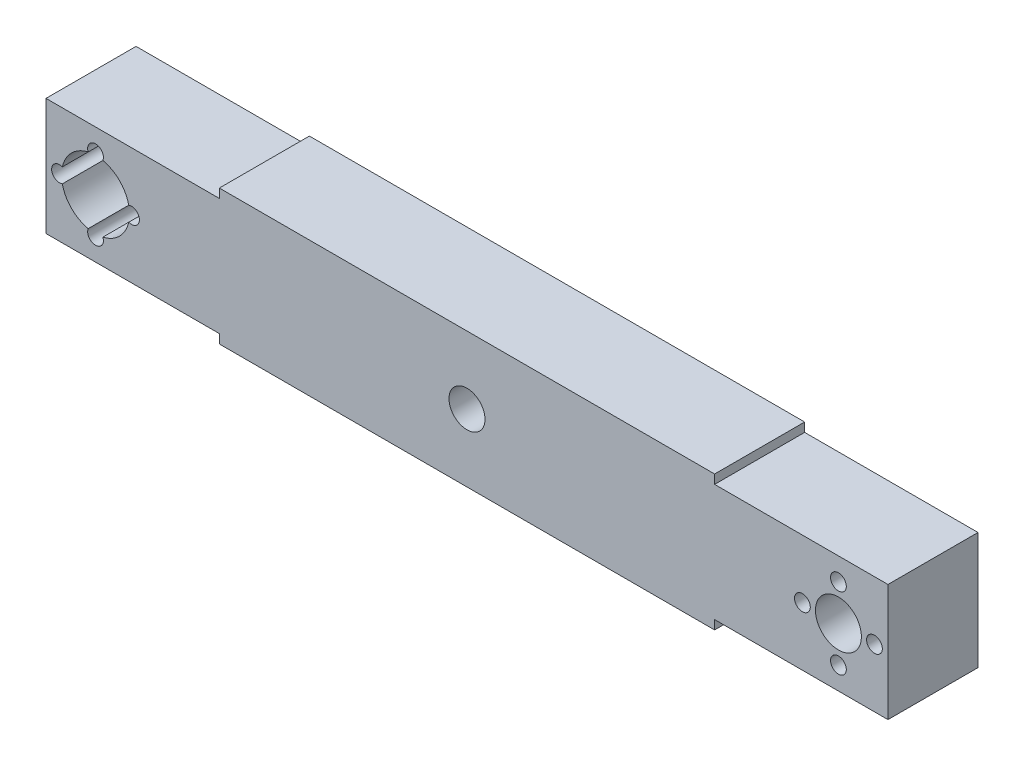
ISO-10303-21;
HEADER;
FILE_DESCRIPTION(('STEP AP214'),'2;1');
FILE_NAME('part.step','',(''),(''),'','','');
FILE_SCHEMA(('AUTOMOTIVE_DESIGN { 1 0 10303 214 1 1 1 1 }'));
ENDSEC;
DATA;
#1=APPLICATION_CONTEXT('core data for automotive mechanical design processes');
#2=APPLICATION_PROTOCOL_DEFINITION('international standard','automotive_design',2000,#1);
#3=PRODUCT_CONTEXT('',#1,'mechanical');
#4=PRODUCT('Part','Part','',(#3));
#5=PRODUCT_RELATED_PRODUCT_CATEGORY('part','',(#4));
#6=PRODUCT_DEFINITION_FORMATION('','',#4);
#7=PRODUCT_DEFINITION_CONTEXT('part definition',#1,'design');
#8=PRODUCT_DEFINITION('design','',#6,#7);
#9=PRODUCT_DEFINITION_SHAPE('','',#8);
#10=(LENGTH_UNIT() NAMED_UNIT(*) SI_UNIT(.MILLI.,.METRE.));
#11=(NAMED_UNIT(*) PLANE_ANGLE_UNIT() SI_UNIT($,.RADIAN.));
#12=(NAMED_UNIT(*) SI_UNIT($,.STERADIAN.) SOLID_ANGLE_UNIT());
#13=UNCERTAINTY_MEASURE_WITH_UNIT(LENGTH_MEASURE(1.E-05),#10,'distance_accuracy_value','');
#14=(GEOMETRIC_REPRESENTATION_CONTEXT(3) GLOBAL_UNCERTAINTY_ASSIGNED_CONTEXT((#13)) GLOBAL_UNIT_ASSIGNED_CONTEXT((#10,
#11,#12)) REPRESENTATION_CONTEXT('',''));
#15=CARTESIAN_POINT('',(0.,0.,0.));
#16=DIRECTION('',(0.,0.,1.));
#17=DIRECTION('',(1.,0.,0.));
#18=AXIS2_PLACEMENT_3D('',#15,#16,#17);
#19=CARTESIAN_POINT('',(55.,-15.,20.));
#20=DIRECTION('',(-1.,0.,0.));
#21=DIRECTION('',(0.,0.,1.));
#22=AXIS2_PLACEMENT_3D('',#19,#20,#21);
#23=PLANE('',#22);
#24=DIRECTION('',(0.,1.,0.));
#25=VECTOR('',#24,1.);
#26=CARTESIAN_POINT('',(55.,-15.,0.));
#27=LINE('',#26,#25);
#28=CARTESIAN_POINT('',(55.,-15.,0.));
#29=VERTEX_POINT('',#28);
#30=CARTESIAN_POINT('',(55.,-13.0000000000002,0.));
#31=VERTEX_POINT('',#30);
#32=EDGE_CURVE('E230',#29,#31,#27,.T.);
#33=ORIENTED_EDGE('',*,*,#32,.T.);
#34=DIRECTION('',(0.,0.,-1.));
#35=VECTOR('',#34,1.);
#36=CARTESIAN_POINT('',(55.,-13.0000000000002,20.001));
#37=LINE('',#36,#35);
#38=CARTESIAN_POINT('',(55.,-13.0000000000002,20.));
#39=VERTEX_POINT('',#38);
#40=EDGE_CURVE('E382',#39,#31,#37,.T.);
#41=ORIENTED_EDGE('',*,*,#40,.F.);
#42=DIRECTION('',(0.,1.,0.));
#43=VECTOR('',#42,1.);
#44=CARTESIAN_POINT('',(55.,-15.,20.));
#45=LINE('',#44,#43);
#46=CARTESIAN_POINT('',(55.,-15.,20.));
#47=VERTEX_POINT('',#46);
#48=EDGE_CURVE('E219',#47,#39,#45,.T.);
#49=ORIENTED_EDGE('',*,*,#48,.F.);
#50=DIRECTION('',(0.,0.,-1.));
#51=VECTOR('',#50,1.);
#52=CARTESIAN_POINT('',(55.,-15.,20.));
#53=LINE('',#52,#51);
#54=EDGE_CURVE('E229',#47,#29,#53,.T.);
#55=ORIENTED_EDGE('',*,*,#54,.T.);
#56=EDGE_LOOP('',(#33,#41,#49,#55));
#57=FACE_BOUND('',#56,.T.);
#58=ADVANCED_FACE('F39',(#57),#23,.F.);
#59=CARTESIAN_POINT('',(-55.,-15.,20.));
#60=DIRECTION('',(1.,0.,0.));
#61=DIRECTION('',(0.,0.,-1.));
#62=AXIS2_PLACEMENT_3D('',#59,#60,#61);
#63=PLANE('',#62);
#64=DIRECTION('',(0.,-1.,0.));
#65=VECTOR('',#64,1.);
#66=CARTESIAN_POINT('',(-55.,-15.,20.));
#67=LINE('',#66,#65);
#68=CARTESIAN_POINT('',(-55.,-13.0000000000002,20.));
#69=VERTEX_POINT('',#68);
#70=CARTESIAN_POINT('',(-55.,-15.,20.));
#71=VERTEX_POINT('',#70);
#72=EDGE_CURVE('E224',#69,#71,#67,.T.);
#73=ORIENTED_EDGE('',*,*,#72,.F.);
#74=DIRECTION('',(0.,0.,-1.));
#75=VECTOR('',#74,1.);
#76=CARTESIAN_POINT('',(-55.,-13.0000000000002,20.001));
#77=LINE('',#76,#75);
#78=CARTESIAN_POINT('',(-55.,-13.0000000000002,0.));
#79=VERTEX_POINT('',#78);
#80=EDGE_CURVE('E279',#69,#79,#77,.T.);
#81=ORIENTED_EDGE('',*,*,#80,.T.);
#82=DIRECTION('',(0.,-1.,0.));
#83=VECTOR('',#82,1.);
#84=CARTESIAN_POINT('',(-55.,-15.,0.));
#85=LINE('',#84,#83);
#86=CARTESIAN_POINT('',(-55.,-15.,0.));
#87=VERTEX_POINT('',#86);
#88=EDGE_CURVE('E234',#79,#87,#85,.T.);
#89=ORIENTED_EDGE('',*,*,#88,.T.);
#90=DIRECTION('',(0.,0.,-1.));
#91=VECTOR('',#90,1.);
#92=CARTESIAN_POINT('',(-55.,-15.,20.));
#93=LINE('',#92,#91);
#94=EDGE_CURVE('E241',#71,#87,#93,.T.);
#95=ORIENTED_EDGE('',*,*,#94,.F.);
#96=EDGE_LOOP('',(#73,#81,#89,#95));
#97=FACE_BOUND('',#96,.T.);
#98=ADVANCED_FACE('F412',(#97),#63,.F.);
#99=CARTESIAN_POINT('',(55.,13.,20.));
#100=VERTEX_POINT('',#99);
#101=CARTESIAN_POINT('',(55.,15.,20.));
#102=VERTEX_POINT('',#101);
#103=EDGE_CURVE('E222',#100,#102,#45,.T.);
#104=ORIENTED_EDGE('',*,*,#103,.F.);
#105=DIRECTION('',(0.,0.,-1.));
#106=VECTOR('',#105,1.);
#107=CARTESIAN_POINT('',(55.,13.,20.001));
#108=LINE('',#107,#106);
#109=CARTESIAN_POINT('',(55.,13.,0.));
#110=VERTEX_POINT('',#109);
#111=EDGE_CURVE('E256',#100,#110,#108,.T.);
#112=ORIENTED_EDGE('',*,*,#111,.T.);
#113=CARTESIAN_POINT('',(55.,15.,0.));
#114=VERTEX_POINT('',#113);
#115=EDGE_CURVE('E214',#110,#114,#27,.T.);
#116=ORIENTED_EDGE('',*,*,#115,.T.);
#117=DIRECTION('',(0.,0.,-1.));
#118=VECTOR('',#117,1.);
#119=CARTESIAN_POINT('',(55.,15.,20.));
#120=LINE('',#119,#118);
#121=EDGE_CURVE('E47',#102,#114,#120,.T.);
#122=ORIENTED_EDGE('',*,*,#121,.F.);
#123=EDGE_LOOP('',(#104,#112,#116,#122));
#124=FACE_BOUND('',#123,.T.);
#125=ADVANCED_FACE('F41',(#124),#23,.F.);
#126=CARTESIAN_POINT('',(-55.,15.,20.));
#127=DIRECTION('',(0.,-1.,0.));
#128=DIRECTION('',(0.,0.,-1.));
#129=AXIS2_PLACEMENT_3D('',#126,#127,#128);
#130=PLANE('',#129);
#131=DIRECTION('',(-1.,0.,0.));
#132=VECTOR('',#131,1.);
#133=CARTESIAN_POINT('',(-55.,15.,0.));
#134=LINE('',#133,#132);
#135=CARTESIAN_POINT('',(-55.,15.,0.));
#136=VERTEX_POINT('',#135);
#137=EDGE_CURVE('E232',#114,#136,#134,.T.);
#138=ORIENTED_EDGE('',*,*,#137,.T.);
#139=DIRECTION('',(0.,0.,-1.));
#140=VECTOR('',#139,1.);
#141=CARTESIAN_POINT('',(-55.,15.,20.));
#142=LINE('',#141,#140);
#143=CARTESIAN_POINT('',(-55.,15.,20.));
#144=VERTEX_POINT('',#143);
#145=EDGE_CURVE('E244',#144,#136,#142,.T.);
#146=ORIENTED_EDGE('',*,*,#145,.F.);
#147=DIRECTION('',(-1.,0.,0.));
#148=VECTOR('',#147,1.);
#149=CARTESIAN_POINT('',(-55.,15.,20.));
#150=LINE('',#149,#148);
#151=EDGE_CURVE('E221',#102,#144,#150,.T.);
#152=ORIENTED_EDGE('',*,*,#151,.F.);
#153=ORIENTED_EDGE('',*,*,#121,.T.);
#154=EDGE_LOOP('',(#138,#146,#152,#153));
#155=FACE_BOUND('',#154,.T.);
#156=ADVANCED_FACE('F250',(#155),#130,.F.);
#157=CARTESIAN_POINT('',(-55.,13.,0.));
#158=VERTEX_POINT('',#157);
#159=EDGE_CURVE('E235',#136,#158,#85,.T.);
#160=ORIENTED_EDGE('',*,*,#159,.T.);
#161=DIRECTION('',(0.,0.,-1.));
#162=VECTOR('',#161,1.);
#163=CARTESIAN_POINT('',(-55.,13.,20.001));
#164=LINE('',#163,#162);
#165=CARTESIAN_POINT('',(-55.,13.,20.));
#166=VERTEX_POINT('',#165);
#167=EDGE_CURVE('E273',#166,#158,#164,.T.);
#168=ORIENTED_EDGE('',*,*,#167,.F.);
#169=EDGE_CURVE('E225',#144,#166,#67,.T.);
#170=ORIENTED_EDGE('',*,*,#169,.F.);
#171=ORIENTED_EDGE('',*,*,#145,.T.);
#172=EDGE_LOOP('',(#160,#168,#170,#171));
#173=FACE_BOUND('',#172,.T.);
#174=ADVANCED_FACE('F271',(#173),#63,.F.);
#175=CARTESIAN_POINT('',(-55.,-15.,20.));
#176=DIRECTION('',(0.,1.,0.));
#177=DIRECTION('',(0.,0.,1.));
#178=AXIS2_PLACEMENT_3D('',#175,#176,#177);
#179=PLANE('',#178);
#180=DIRECTION('',(1.,0.,0.));
#181=VECTOR('',#180,1.);
#182=CARTESIAN_POINT('',(-55.,-15.,0.));
#183=LINE('',#182,#181);
#184=EDGE_CURVE('E237',#87,#29,#183,.T.);
#185=ORIENTED_EDGE('',*,*,#184,.T.);
#186=ORIENTED_EDGE('',*,*,#54,.F.);
#187=DIRECTION('',(1.,0.,0.));
#188=VECTOR('',#187,1.);
#189=CARTESIAN_POINT('',(-55.,-15.,20.));
#190=LINE('',#189,#188);
#191=EDGE_CURVE('E227',#71,#47,#190,.T.);
#192=ORIENTED_EDGE('',*,*,#191,.F.);
#193=ORIENTED_EDGE('',*,*,#94,.T.);
#194=EDGE_LOOP('',(#185,#186,#192,#193));
#195=FACE_BOUND('',#194,.T.);
#196=ADVANCED_FACE('F407',(#195),#179,.F.);
#197=CARTESIAN_POINT('',(0.,0.,20.));
#198=DIRECTION('',(0.,0.,-1.));
#199=DIRECTION('',(-1.,0.,0.));
#200=AXIS2_PLACEMENT_3D('',#197,#198,#199);
#201=PLANE('',#200);
#202=CARTESIAN_POINT('',(0.,0.,20.));
#203=DIRECTION('',(0.,0.,-1.));
#204=DIRECTION('',(-1.,0.,0.));
#205=AXIS2_PLACEMENT_3D('',#202,#203,#204);
#206=CIRCLE('',#205,4.);
#207=CARTESIAN_POINT('',(-4.,0.,20.));
#208=VERTEX_POINT('',#207);
#209=EDGE_CURVE('E290',#208,#208,#206,.F.);
#210=ORIENTED_EDGE('',*,*,#209,.F.);
#211=EDGE_LOOP('',(#210));
#212=FACE_BOUND('',#211,.T.);
#213=ORIENTED_EDGE('',*,*,#48,.T.);
#214=DIRECTION('',(-1.,0.,0.));
#215=VECTOR('',#214,1.);
#216=CARTESIAN_POINT('',(56.,-13.0000000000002,20.));
#217=LINE('',#216,#215);
#218=CARTESIAN_POINT('',(93.5,-13.0000000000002,20.));
#219=VERTEX_POINT('',#218);
#220=EDGE_CURVE('E368',#219,#39,#217,.T.);
#221=ORIENTED_EDGE('',*,*,#220,.F.);
#222=DIRECTION('',(0.,-1.,0.));
#223=VECTOR('',#222,1.);
#224=CARTESIAN_POINT('',(93.5,13.,20.));
#225=LINE('',#224,#223);
#226=CARTESIAN_POINT('',(93.5,13.,20.));
#227=VERTEX_POINT('',#226);
#228=EDGE_CURVE('E304',#227,#219,#225,.T.);
#229=ORIENTED_EDGE('',*,*,#228,.F.);
#230=DIRECTION('',(1.,0.,0.));
#231=VECTOR('',#230,1.);
#232=CARTESIAN_POINT('',(56.,13.,20.));
#233=LINE('',#232,#231);
#234=EDGE_CURVE('E335',#100,#227,#233,.T.);
#235=ORIENTED_EDGE('',*,*,#234,.F.);
#236=ORIENTED_EDGE('',*,*,#103,.T.);
#237=ORIENTED_EDGE('',*,*,#151,.T.);
#238=ORIENTED_EDGE('',*,*,#169,.T.);
#239=DIRECTION('',(1.,0.,0.));
#240=VECTOR('',#239,1.);
#241=CARTESIAN_POINT('',(-56.,13.,20.));
#242=LINE('',#241,#240);
#243=CARTESIAN_POINT('',(-93.5,13.,20.));
#244=VERTEX_POINT('',#243);
#245=EDGE_CURVE('E278',#244,#166,#242,.T.);
#246=ORIENTED_EDGE('',*,*,#245,.F.);
#247=DIRECTION('',(0.,1.,0.));
#248=VECTOR('',#247,1.);
#249=CARTESIAN_POINT('',(-93.5,13.,20.));
#250=LINE('',#249,#248);
#251=CARTESIAN_POINT('',(-93.5,-13.0000000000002,20.));
#252=VERTEX_POINT('',#251);
#253=EDGE_CURVE('E298',#252,#244,#250,.T.);
#254=ORIENTED_EDGE('',*,*,#253,.F.);
#255=DIRECTION('',(-1.,0.,0.));
#256=VECTOR('',#255,1.);
#257=CARTESIAN_POINT('',(-56.,-13.0000000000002,20.));
#258=LINE('',#257,#256);
#259=EDGE_CURVE('E301',#69,#252,#258,.T.);
#260=ORIENTED_EDGE('',*,*,#259,.F.);
#261=ORIENTED_EDGE('',*,*,#72,.T.);
#262=ORIENTED_EDGE('',*,*,#191,.T.);
#263=EDGE_LOOP('',(#213,#221,#229,#235,#236,#237,#238,#246,#254,#260,#261,#262));
#264=FACE_BOUND('',#263,.T.);
#265=CARTESIAN_POINT('',(82.5,-8.00000000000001,20.));
#266=DIRECTION('',(0.,0.,-1.));
#267=DIRECTION('',(-1.,0.,0.));
#268=AXIS2_PLACEMENT_3D('',#265,#266,#267);
#269=CIRCLE('',#268,1.75);
#270=CARTESIAN_POINT('',(80.75,-8.00000000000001,20.));
#271=VERTEX_POINT('',#270);
#272=EDGE_CURVE('E315',#271,#271,#269,.T.);
#273=ORIENTED_EDGE('',*,*,#272,.T.);
#274=EDGE_LOOP('',(#273));
#275=FACE_BOUND('',#274,.T.);
#276=CARTESIAN_POINT('',(74.5,0.,20.));
#277=DIRECTION('',(0.,0.,-1.));
#278=DIRECTION('',(-1.,0.,0.));
#279=AXIS2_PLACEMENT_3D('',#276,#277,#278);
#280=CIRCLE('',#279,1.75);
#281=CARTESIAN_POINT('',(72.75,0.,20.));
#282=VERTEX_POINT('',#281);
#283=EDGE_CURVE('E309',#282,#282,#280,.T.);
#284=ORIENTED_EDGE('',*,*,#283,.T.);
#285=EDGE_LOOP('',(#284));
#286=FACE_BOUND('',#285,.T.);
#287=CARTESIAN_POINT('',(82.5,8.00000000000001,20.));
#288=DIRECTION('',(0.,0.,-1.));
#289=DIRECTION('',(-1.,0.,0.));
#290=AXIS2_PLACEMENT_3D('',#287,#288,#289);
#291=CIRCLE('',#290,1.75);
#292=CARTESIAN_POINT('',(80.75,8.00000000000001,20.));
#293=VERTEX_POINT('',#292);
#294=EDGE_CURVE('E308',#293,#293,#291,.T.);
#295=ORIENTED_EDGE('',*,*,#294,.T.);
#296=EDGE_LOOP('',(#295));
#297=FACE_BOUND('',#296,.T.);
#298=CARTESIAN_POINT('',(90.5,0.,20.));
#299=DIRECTION('',(0.,0.,-1.));
#300=DIRECTION('',(-1.,0.,0.));
#301=AXIS2_PLACEMENT_3D('',#298,#299,#300);
#302=CIRCLE('',#301,1.75);
#303=CARTESIAN_POINT('',(88.75,0.,20.));
#304=VERTEX_POINT('',#303);
#305=EDGE_CURVE('E321',#304,#304,#302,.T.);
#306=ORIENTED_EDGE('',*,*,#305,.T.);
#307=EDGE_LOOP('',(#306));
#308=FACE_BOUND('',#307,.T.);
#309=CARTESIAN_POINT('',(-74.5,0.,20.));
#310=DIRECTION('',(0.,0.,-1.));
#311=DIRECTION('',(1.,0.,0.));
#312=AXIS2_PLACEMENT_3D('',#309,#310,#311);
#313=CIRCLE('',#312,1.75);
#314=CARTESIAN_POINT('',(-75.12875,1.63314832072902,20.));
#315=VERTEX_POINT('',#314);
#316=CARTESIAN_POINT('',(-75.12875,-1.633148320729,20.));
#317=VERTEX_POINT('',#316);
#318=EDGE_CURVE('E194',#315,#317,#313,.T.);
#319=ORIENTED_EDGE('',*,*,#318,.T.);
#320=CARTESIAN_POINT('',(-82.5,0.,20.));
#321=DIRECTION('',(0.,0.,1.));
#322=DIRECTION('',(1.,0.,0.));
#323=AXIS2_PLACEMENT_3D('',#320,#321,#322);
#324=CIRCLE('',#323,7.55);
#325=CARTESIAN_POINT('',(-80.866851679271,-7.37124999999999,20.));
#326=VERTEX_POINT('',#325);
#327=EDGE_CURVE('E54',#326,#317,#324,.T.);
#328=ORIENTED_EDGE('',*,*,#327,.F.);
#329=CARTESIAN_POINT('',(-82.5,-7.99999999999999,20.));
#330=DIRECTION('',(0.,0.,-1.));
#331=DIRECTION('',(1.,0.,0.));
#332=AXIS2_PLACEMENT_3D('',#329,#330,#331);
#333=CIRCLE('',#332,1.75);
#334=CARTESIAN_POINT('',(-84.133148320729,-7.37124999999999,20.));
#335=VERTEX_POINT('',#334);
#336=EDGE_CURVE('E204',#326,#335,#333,.T.);
#337=ORIENTED_EDGE('',*,*,#336,.T.);
#338=CARTESIAN_POINT('',(-89.87125,-1.633148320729,20.));
#339=VERTEX_POINT('',#338);
#340=EDGE_CURVE('E340',#339,#335,#324,.T.);
#341=ORIENTED_EDGE('',*,*,#340,.F.);
#342=CARTESIAN_POINT('',(-90.5,0.,20.));
#343=DIRECTION('',(0.,0.,-1.));
#344=DIRECTION('',(1.,0.,0.));
#345=AXIS2_PLACEMENT_3D('',#342,#343,#344);
#346=CIRCLE('',#345,1.75);
#347=CARTESIAN_POINT('',(-89.87125,1.63314832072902,20.));
#348=VERTEX_POINT('',#347);
#349=EDGE_CURVE('E207',#339,#348,#346,.T.);
#350=ORIENTED_EDGE('',*,*,#349,.T.);
#351=CARTESIAN_POINT('',(-84.133148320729,7.37125000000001,20.));
#352=VERTEX_POINT('',#351);
#353=EDGE_CURVE('E198',#352,#348,#324,.T.);
#354=ORIENTED_EDGE('',*,*,#353,.F.);
#355=CARTESIAN_POINT('',(-82.5,8.00000000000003,20.));
#356=DIRECTION('',(0.,0.,-1.));
#357=DIRECTION('',(1.,0.,0.));
#358=AXIS2_PLACEMENT_3D('',#355,#356,#357);
#359=CIRCLE('',#358,1.75);
#360=CARTESIAN_POINT('',(-80.866851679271,7.37125000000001,20.));
#361=VERTEX_POINT('',#360);
#362=EDGE_CURVE('E197',#352,#361,#359,.T.);
#363=ORIENTED_EDGE('',*,*,#362,.T.);
#364=EDGE_CURVE('E178',#315,#361,#324,.T.);
#365=ORIENTED_EDGE('',*,*,#364,.F.);
#366=EDGE_LOOP('',(#319,#328,#337,#341,#350,#354,#363,#365));
#367=FACE_BOUND('',#366,.T.);
#368=CARTESIAN_POINT('',(82.5,0.,20.));
#369=DIRECTION('',(0.,0.,-1.));
#370=DIRECTION('',(-1.,0.,0.));
#371=AXIS2_PLACEMENT_3D('',#368,#369,#370);
#372=CIRCLE('',#371,5.1);
#373=CARTESIAN_POINT('',(77.4,0.,20.));
#374=VERTEX_POINT('',#373);
#375=EDGE_CURVE('E211',#374,#374,#372,.T.);
#376=ORIENTED_EDGE('',*,*,#375,.T.);
#377=EDGE_LOOP('',(#376));
#378=FACE_BOUND('',#377,.T.);
#379=ADVANCED_FACE('F192',(#212,#264,#275,#286,#297,#308,#367,#378),#201,.F.);
#380=CARTESIAN_POINT('',(0.,0.,0.));
#381=DIRECTION('',(0.,0.,-1.));
#382=DIRECTION('',(-1.,0.,0.));
#383=AXIS2_PLACEMENT_3D('',#380,#381,#382);
#384=PLANE('',#383);
#385=CARTESIAN_POINT('',(-82.5,0.,0.));
#386=DIRECTION('',(0.,0.,-1.));
#387=DIRECTION('',(-1.,0.,0.));
#388=AXIS2_PLACEMENT_3D('',#385,#386,#387);
#389=CIRCLE('',#388,7.55);
#390=CARTESIAN_POINT('',(-80.866851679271,-7.37124999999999,0.));
#391=VERTEX_POINT('',#390);
#392=CARTESIAN_POINT('',(-75.12875,-1.633148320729,0.));
#393=VERTEX_POINT('',#392);
#394=EDGE_CURVE('E354',#391,#393,#389,.F.);
#395=ORIENTED_EDGE('',*,*,#394,.T.);
#396=CARTESIAN_POINT('',(-74.5,0.,0.));
#397=DIRECTION('',(0.,0.,-1.));
#398=DIRECTION('',(1.,0.,0.));
#399=AXIS2_PLACEMENT_3D('',#396,#397,#398);
#400=CIRCLE('',#399,1.75);
#401=CARTESIAN_POINT('',(-75.12875,1.63314832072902,0.));
#402=VERTEX_POINT('',#401);
#403=EDGE_CURVE('E201',#402,#393,#400,.T.);
#404=ORIENTED_EDGE('',*,*,#403,.F.);
#405=CARTESIAN_POINT('',(-80.866851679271,7.37125000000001,0.));
#406=VERTEX_POINT('',#405);
#407=EDGE_CURVE('E181',#402,#406,#389,.F.);
#408=ORIENTED_EDGE('',*,*,#407,.T.);
#409=CARTESIAN_POINT('',(-82.5,8.00000000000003,0.));
#410=DIRECTION('',(0.,0.,-1.));
#411=DIRECTION('',(1.,0.,0.));
#412=AXIS2_PLACEMENT_3D('',#409,#410,#411);
#413=CIRCLE('',#412,1.75);
#414=CARTESIAN_POINT('',(-84.133148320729,7.37125000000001,0.));
#415=VERTEX_POINT('',#414);
#416=EDGE_CURVE('E331',#415,#406,#413,.T.);
#417=ORIENTED_EDGE('',*,*,#416,.F.);
#418=CARTESIAN_POINT('',(-89.87125,1.63314832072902,0.));
#419=VERTEX_POINT('',#418);
#420=EDGE_CURVE('E353',#415,#419,#389,.F.);
#421=ORIENTED_EDGE('',*,*,#420,.T.);
#422=CARTESIAN_POINT('',(-90.5,0.,0.));
#423=DIRECTION('',(0.,0.,-1.));
#424=DIRECTION('',(1.,0.,0.));
#425=AXIS2_PLACEMENT_3D('',#422,#423,#424);
#426=CIRCLE('',#425,1.75);
#427=CARTESIAN_POINT('',(-89.87125,-1.63314832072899,0.));
#428=VERTEX_POINT('',#427);
#429=EDGE_CURVE('E202',#428,#419,#426,.T.);
#430=ORIENTED_EDGE('',*,*,#429,.F.);
#431=CARTESIAN_POINT('',(-84.133148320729,-7.37124999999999,0.));
#432=VERTEX_POINT('',#431);
#433=EDGE_CURVE('E62',#428,#432,#389,.F.);
#434=ORIENTED_EDGE('',*,*,#433,.T.);
#435=CARTESIAN_POINT('',(-82.5,-7.99999999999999,0.));
#436=DIRECTION('',(0.,0.,-1.));
#437=DIRECTION('',(1.,0.,0.));
#438=AXIS2_PLACEMENT_3D('',#435,#436,#437);
#439=CIRCLE('',#438,1.75);
#440=EDGE_CURVE('E318',#391,#432,#439,.T.);
#441=ORIENTED_EDGE('',*,*,#440,.F.);
#442=EDGE_LOOP('',(#395,#404,#408,#417,#421,#430,#434,#441));
#443=FACE_BOUND('',#442,.T.);
#444=CARTESIAN_POINT('',(0.,0.,0.));
#445=DIRECTION('',(0.,0.,-1.));
#446=DIRECTION('',(-1.,0.,0.));
#447=AXIS2_PLACEMENT_3D('',#444,#445,#446);
#448=CIRCLE('',#447,11.1853629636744);
#449=CARTESIAN_POINT('',(11.1853629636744,0.,0.));
#450=VERTEX_POINT('',#449);
#451=EDGE_CURVE('E11',#450,#450,#448,.T.);
#452=ORIENTED_EDGE('',*,*,#451,.F.);
#453=EDGE_LOOP('',(#452));
#454=FACE_BOUND('',#453,.T.);
#455=DIRECTION('',(1.,0.,0.));
#456=VECTOR('',#455,1.);
#457=CARTESIAN_POINT('',(56.,-13.0000000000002,0.));
#458=LINE('',#457,#456);
#459=CARTESIAN_POINT('',(93.5,-13.0000000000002,0.));
#460=VERTEX_POINT('',#459);
#461=EDGE_CURVE('E376',#31,#460,#458,.T.);
#462=ORIENTED_EDGE('',*,*,#461,.F.);
#463=ORIENTED_EDGE('',*,*,#32,.F.);
#464=ORIENTED_EDGE('',*,*,#184,.F.);
#465=ORIENTED_EDGE('',*,*,#88,.F.);
#466=DIRECTION('',(1.,0.,0.));
#467=VECTOR('',#466,1.);
#468=CARTESIAN_POINT('',(-56.,-13.0000000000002,0.));
#469=LINE('',#468,#467);
#470=CARTESIAN_POINT('',(-93.5,-13.0000000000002,0.));
#471=VERTEX_POINT('',#470);
#472=EDGE_CURVE('E283',#471,#79,#469,.T.);
#473=ORIENTED_EDGE('',*,*,#472,.F.);
#474=DIRECTION('',(0.,-1.,0.));
#475=VECTOR('',#474,1.);
#476=CARTESIAN_POINT('',(-93.5,13.,0.));
#477=LINE('',#476,#475);
#478=CARTESIAN_POINT('',(-93.5,13.,0.));
#479=VERTEX_POINT('',#478);
#480=EDGE_CURVE('E293',#479,#471,#477,.T.);
#481=ORIENTED_EDGE('',*,*,#480,.F.);
#482=DIRECTION('',(-1.,0.,0.));
#483=VECTOR('',#482,1.);
#484=CARTESIAN_POINT('',(-56.,13.,0.));
#485=LINE('',#484,#483);
#486=EDGE_CURVE('E267',#158,#479,#485,.T.);
#487=ORIENTED_EDGE('',*,*,#486,.F.);
#488=ORIENTED_EDGE('',*,*,#159,.F.);
#489=ORIENTED_EDGE('',*,*,#137,.F.);
#490=ORIENTED_EDGE('',*,*,#115,.F.);
#491=DIRECTION('',(-1.,0.,0.));
#492=VECTOR('',#491,1.);
#493=CARTESIAN_POINT('',(56.,13.,0.));
#494=LINE('',#493,#492);
#495=CARTESIAN_POINT('',(93.5,13.,0.));
#496=VERTEX_POINT('',#495);
#497=EDGE_CURVE('E374',#496,#110,#494,.T.);
#498=ORIENTED_EDGE('',*,*,#497,.F.);
#499=DIRECTION('',(0.,1.,0.));
#500=VECTOR('',#499,1.);
#501=CARTESIAN_POINT('',(93.5,13.,0.));
#502=LINE('',#501,#500);
#503=EDGE_CURVE('E371',#460,#496,#502,.T.);
#504=ORIENTED_EDGE('',*,*,#503,.F.);
#505=EDGE_LOOP('',(#462,#463,#464,#465,#473,#481,#487,#488,#489,#490,#498,#504));
#506=FACE_BOUND('',#505,.T.);
#507=CARTESIAN_POINT('',(82.5,-8.00000000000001,0.));
#508=DIRECTION('',(0.,0.,-1.));
#509=DIRECTION('',(-1.,0.,0.));
#510=AXIS2_PLACEMENT_3D('',#507,#508,#509);
#511=CIRCLE('',#510,1.75);
#512=CARTESIAN_POINT('',(80.75,-8.00000000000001,0.));
#513=VERTEX_POINT('',#512);
#514=EDGE_CURVE('E312',#513,#513,#511,.T.);
#515=ORIENTED_EDGE('',*,*,#514,.F.);
#516=EDGE_LOOP('',(#515));
#517=FACE_BOUND('',#516,.T.);
#518=CARTESIAN_POINT('',(74.5,0.,0.));
#519=DIRECTION('',(0.,0.,-1.));
#520=DIRECTION('',(-1.,0.,0.));
#521=AXIS2_PLACEMENT_3D('',#518,#519,#520);
#522=CIRCLE('',#521,1.75);
#523=CARTESIAN_POINT('',(72.75,0.,0.));
#524=VERTEX_POINT('',#523);
#525=EDGE_CURVE('E305',#524,#524,#522,.T.);
#526=ORIENTED_EDGE('',*,*,#525,.F.);
#527=EDGE_LOOP('',(#526));
#528=FACE_BOUND('',#527,.T.);
#529=CARTESIAN_POINT('',(82.5,8.00000000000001,0.));
#530=DIRECTION('',(0.,0.,-1.));
#531=DIRECTION('',(-1.,0.,0.));
#532=AXIS2_PLACEMENT_3D('',#529,#530,#531);
#533=CIRCLE('',#532,1.75);
#534=CARTESIAN_POINT('',(80.75,8.00000000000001,0.));
#535=VERTEX_POINT('',#534);
#536=EDGE_CURVE('E324',#535,#535,#533,.T.);
#537=ORIENTED_EDGE('',*,*,#536,.F.);
#538=EDGE_LOOP('',(#537));
#539=FACE_BOUND('',#538,.T.);
#540=CARTESIAN_POINT('',(90.5,0.,0.));
#541=DIRECTION('',(0.,0.,-1.));
#542=DIRECTION('',(-1.,0.,0.));
#543=AXIS2_PLACEMENT_3D('',#540,#541,#542);
#544=CIRCLE('',#543,1.75);
#545=CARTESIAN_POINT('',(88.75,0.,0.));
#546=VERTEX_POINT('',#545);
#547=EDGE_CURVE('E218',#546,#546,#544,.T.);
#548=ORIENTED_EDGE('',*,*,#547,.F.);
#549=EDGE_LOOP('',(#548));
#550=FACE_BOUND('',#549,.T.);
#551=CARTESIAN_POINT('',(82.5,0.,0.));
#552=DIRECTION('',(0.,0.,-1.));
#553=DIRECTION('',(-1.,0.,0.));
#554=AXIS2_PLACEMENT_3D('',#551,#552,#553);
#555=CIRCLE('',#554,5.1);
#556=CARTESIAN_POINT('',(77.4,0.,0.));
#557=VERTEX_POINT('',#556);
#558=EDGE_CURVE('E215',#557,#557,#555,.T.);
#559=ORIENTED_EDGE('',*,*,#558,.F.);
#560=EDGE_LOOP('',(#559));
#561=FACE_BOUND('',#560,.T.);
#562=ADVANCED_FACE('F262',(#443,#454,#506,#517,#528,#539,#550,#561),#384,.T.);
#563=CARTESIAN_POINT('',(82.5,0.,20.));
#564=DIRECTION('',(0.,0.,-1.));
#565=DIRECTION('',(-1.,0.,0.));
#566=AXIS2_PLACEMENT_3D('',#563,#564,#565);
#567=CYLINDRICAL_SURFACE('',#566,5.1);
#568=ORIENTED_EDGE('',*,*,#375,.F.);
#569=EDGE_LOOP('',(#568));
#570=FACE_BOUND('',#569,.T.);
#571=ORIENTED_EDGE('',*,*,#558,.T.);
#572=EDGE_LOOP('',(#571));
#573=FACE_BOUND('',#572,.T.);
#574=ADVANCED_FACE('F446',(#570,#573),#567,.F.);
#575=CARTESIAN_POINT('',(-82.5,-7.99999999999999,20.));
#576=DIRECTION('',(0.,0.,-1.));
#577=DIRECTION('',(-1.,0.,0.));
#578=AXIS2_PLACEMENT_3D('',#575,#576,#577);
#579=CYLINDRICAL_SURFACE('',#578,1.75);
#580=ORIENTED_EDGE('',*,*,#336,.F.);
#581=DIRECTION('',(0.,0.,-1.));
#582=VECTOR('',#581,1.);
#583=CARTESIAN_POINT('',(-80.866851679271,-7.37124999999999,10.));
#584=LINE('',#583,#582);
#585=EDGE_CURVE('E346',#391,#326,#584,.F.);
#586=ORIENTED_EDGE('',*,*,#585,.F.);
#587=ORIENTED_EDGE('',*,*,#440,.T.);
#588=DIRECTION('',(0.,0.,-1.));
#589=VECTOR('',#588,1.);
#590=CARTESIAN_POINT('',(-84.133148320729,-7.37124999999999,10.));
#591=LINE('',#590,#589);
#592=EDGE_CURVE('E186',#335,#432,#591,.T.);
#593=ORIENTED_EDGE('',*,*,#592,.F.);
#594=EDGE_LOOP('',(#580,#586,#587,#593));
#595=FACE_BOUND('',#594,.T.);
#596=ADVANCED_FACE('F345',(#595),#579,.F.);
#597=CARTESIAN_POINT('',(-74.5,0.,20.));
#598=DIRECTION('',(0.,0.,-1.));
#599=DIRECTION('',(-1.,0.,0.));
#600=AXIS2_PLACEMENT_3D('',#597,#598,#599);
#601=CYLINDRICAL_SURFACE('',#600,1.75);
#602=ORIENTED_EDGE('',*,*,#403,.T.);
#603=DIRECTION('',(0.,0.,-1.));
#604=VECTOR('',#603,1.);
#605=CARTESIAN_POINT('',(-75.12875,-1.633148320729,10.));
#606=LINE('',#605,#604);
#607=EDGE_CURVE('E187',#317,#393,#606,.T.);
#608=ORIENTED_EDGE('',*,*,#607,.F.);
#609=ORIENTED_EDGE('',*,*,#318,.F.);
#610=DIRECTION('',(0.,0.,-1.));
#611=VECTOR('',#610,1.);
#612=CARTESIAN_POINT('',(-75.12875,1.63314832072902,10.));
#613=LINE('',#612,#611);
#614=EDGE_CURVE('E175',#402,#315,#613,.F.);
#615=ORIENTED_EDGE('',*,*,#614,.F.);
#616=EDGE_LOOP('',(#602,#608,#609,#615));
#617=FACE_BOUND('',#616,.T.);
#618=ADVANCED_FACE('F200',(#617),#601,.F.);
#619=CARTESIAN_POINT('',(-90.5,0.,20.));
#620=DIRECTION('',(0.,0.,-1.));
#621=DIRECTION('',(-1.,0.,0.));
#622=AXIS2_PLACEMENT_3D('',#619,#620,#621);
#623=CYLINDRICAL_SURFACE('',#622,1.75);
#624=ORIENTED_EDGE('',*,*,#349,.F.);
#625=DIRECTION('',(0.,0.,-1.));
#626=VECTOR('',#625,1.);
#627=CARTESIAN_POINT('',(-89.87125,-1.63314832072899,10.));
#628=LINE('',#627,#626);
#629=EDGE_CURVE('E672',#428,#339,#628,.F.);
#630=ORIENTED_EDGE('',*,*,#629,.F.);
#631=ORIENTED_EDGE('',*,*,#429,.T.);
#632=DIRECTION('',(0.,0.,-1.));
#633=VECTOR('',#632,1.);
#634=CARTESIAN_POINT('',(-89.87125,1.63314832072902,10.));
#635=LINE('',#634,#633);
#636=EDGE_CURVE('E671',#348,#419,#635,.T.);
#637=ORIENTED_EDGE('',*,*,#636,.F.);
#638=EDGE_LOOP('',(#624,#630,#631,#637));
#639=FACE_BOUND('',#638,.T.);
#640=ADVANCED_FACE('F456',(#639),#623,.F.);
#641=CARTESIAN_POINT('',(-82.5,8.00000000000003,20.));
#642=DIRECTION('',(0.,0.,-1.));
#643=DIRECTION('',(-1.,0.,0.));
#644=AXIS2_PLACEMENT_3D('',#641,#642,#643);
#645=CYLINDRICAL_SURFACE('',#644,1.75);
#646=ORIENTED_EDGE('',*,*,#362,.F.);
#647=DIRECTION('',(0.,0.,-1.));
#648=VECTOR('',#647,1.);
#649=CARTESIAN_POINT('',(-84.133148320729,7.37125000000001,10.));
#650=LINE('',#649,#648);
#651=EDGE_CURVE('E674',#415,#352,#650,.F.);
#652=ORIENTED_EDGE('',*,*,#651,.F.);
#653=ORIENTED_EDGE('',*,*,#416,.T.);
#654=DIRECTION('',(0.,0.,-1.));
#655=VECTOR('',#654,1.);
#656=CARTESIAN_POINT('',(-80.866851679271,7.37125000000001,10.));
#657=LINE('',#656,#655);
#658=EDGE_CURVE('E678',#361,#406,#657,.T.);
#659=ORIENTED_EDGE('',*,*,#658,.F.);
#660=EDGE_LOOP('',(#646,#652,#653,#659));
#661=FACE_BOUND('',#660,.T.);
#662=ADVANCED_FACE('F459',(#661),#645,.F.);
#663=CARTESIAN_POINT('',(90.5,0.,20.));
#664=DIRECTION('',(0.,0.,-1.));
#665=DIRECTION('',(-1.,0.,0.));
#666=AXIS2_PLACEMENT_3D('',#663,#664,#665);
#667=CYLINDRICAL_SURFACE('',#666,1.75);
#668=ORIENTED_EDGE('',*,*,#305,.F.);
#669=EDGE_LOOP('',(#668));
#670=FACE_BOUND('',#669,.T.);
#671=ORIENTED_EDGE('',*,*,#547,.T.);
#672=EDGE_LOOP('',(#671));
#673=FACE_BOUND('',#672,.T.);
#674=ADVANCED_FACE('F462',(#670,#673),#667,.F.);
#675=CARTESIAN_POINT('',(82.5,8.00000000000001,20.));
#676=DIRECTION('',(0.,0.,-1.));
#677=DIRECTION('',(-1.,0.,0.));
#678=AXIS2_PLACEMENT_3D('',#675,#676,#677);
#679=CYLINDRICAL_SURFACE('',#678,1.75);
#680=ORIENTED_EDGE('',*,*,#294,.F.);
#681=EDGE_LOOP('',(#680));
#682=FACE_BOUND('',#681,.T.);
#683=ORIENTED_EDGE('',*,*,#536,.T.);
#684=EDGE_LOOP('',(#683));
#685=FACE_BOUND('',#684,.T.);
#686=ADVANCED_FACE('F467',(#682,#685),#679,.F.);
#687=CARTESIAN_POINT('',(74.5,0.,20.));
#688=DIRECTION('',(0.,0.,-1.));
#689=DIRECTION('',(-1.,0.,0.));
#690=AXIS2_PLACEMENT_3D('',#687,#688,#689);
#691=CYLINDRICAL_SURFACE('',#690,1.75);
#692=ORIENTED_EDGE('',*,*,#283,.F.);
#693=EDGE_LOOP('',(#692));
#694=FACE_BOUND('',#693,.T.);
#695=ORIENTED_EDGE('',*,*,#525,.T.);
#696=EDGE_LOOP('',(#695));
#697=FACE_BOUND('',#696,.T.);
#698=ADVANCED_FACE('F470',(#694,#697),#691,.F.);
#699=CARTESIAN_POINT('',(82.5,-8.00000000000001,20.));
#700=DIRECTION('',(0.,0.,-1.));
#701=DIRECTION('',(-1.,0.,0.));
#702=AXIS2_PLACEMENT_3D('',#699,#700,#701);
#703=CYLINDRICAL_SURFACE('',#702,1.75);
#704=ORIENTED_EDGE('',*,*,#272,.F.);
#705=EDGE_LOOP('',(#704));
#706=FACE_BOUND('',#705,.T.);
#707=ORIENTED_EDGE('',*,*,#514,.T.);
#708=EDGE_LOOP('',(#707));
#709=FACE_BOUND('',#708,.T.);
#710=ADVANCED_FACE('F475',(#706,#709),#703,.F.);
#711=CARTESIAN_POINT('',(93.5,13.,20.001));
#712=DIRECTION('',(-1.,0.,0.));
#713=DIRECTION('',(0.,0.,1.));
#714=AXIS2_PLACEMENT_3D('',#711,#712,#713);
#715=PLANE('',#714);
#716=ORIENTED_EDGE('',*,*,#228,.T.);
#717=DIRECTION('',(0.,0.,-1.));
#718=VECTOR('',#717,1.);
#719=CARTESIAN_POINT('',(93.5,-13.0000000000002,20.001));
#720=LINE('',#719,#718);
#721=EDGE_CURVE('E380',#219,#460,#720,.T.);
#722=ORIENTED_EDGE('',*,*,#721,.T.);
#723=ORIENTED_EDGE('',*,*,#503,.T.);
#724=DIRECTION('',(0.,0.,-1.));
#725=VECTOR('',#724,1.);
#726=CARTESIAN_POINT('',(93.5,13.,20.001));
#727=LINE('',#726,#725);
#728=EDGE_CURVE('E379',#227,#496,#727,.T.);
#729=ORIENTED_EDGE('',*,*,#728,.F.);
#730=EDGE_LOOP('',(#716,#722,#723,#729));
#731=FACE_BOUND('',#730,.T.);
#732=ADVANCED_FACE('F395',(#731),#715,.F.);
#733=CARTESIAN_POINT('',(56.,-13.0000000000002,20.001));
#734=DIRECTION('',(0.,1.,0.));
#735=DIRECTION('',(-1.,0.,0.));
#736=AXIS2_PLACEMENT_3D('',#733,#734,#735);
#737=PLANE('',#736);
#738=ORIENTED_EDGE('',*,*,#220,.T.);
#739=ORIENTED_EDGE('',*,*,#40,.T.);
#740=ORIENTED_EDGE('',*,*,#461,.T.);
#741=ORIENTED_EDGE('',*,*,#721,.F.);
#742=EDGE_LOOP('',(#738,#739,#740,#741));
#743=FACE_BOUND('',#742,.T.);
#744=ADVANCED_FACE('F400',(#743),#737,.F.);
#745=CARTESIAN_POINT('',(56.,13.,20.001));
#746=DIRECTION('',(0.,-1.,0.));
#747=DIRECTION('',(0.,0.,-1.));
#748=AXIS2_PLACEMENT_3D('',#745,#746,#747);
#749=PLANE('',#748);
#750=ORIENTED_EDGE('',*,*,#234,.T.);
#751=ORIENTED_EDGE('',*,*,#728,.T.);
#752=ORIENTED_EDGE('',*,*,#497,.T.);
#753=ORIENTED_EDGE('',*,*,#111,.F.);
#754=EDGE_LOOP('',(#750,#751,#752,#753));
#755=FACE_BOUND('',#754,.T.);
#756=ADVANCED_FACE('F390',(#755),#749,.F.);
#757=CARTESIAN_POINT('',(-56.,-13.0000000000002,20.001));
#758=DIRECTION('',(0.,1.,0.));
#759=DIRECTION('',(-1.,0.,0.));
#760=AXIS2_PLACEMENT_3D('',#757,#758,#759);
#761=PLANE('',#760);
#762=ORIENTED_EDGE('',*,*,#259,.T.);
#763=DIRECTION('',(0.,0.,-1.));
#764=VECTOR('',#763,1.);
#765=CARTESIAN_POINT('',(-93.5,-13.0000000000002,20.001));
#766=LINE('',#765,#764);
#767=EDGE_CURVE('E285',#252,#471,#766,.T.);
#768=ORIENTED_EDGE('',*,*,#767,.T.);
#769=ORIENTED_EDGE('',*,*,#472,.T.);
#770=ORIENTED_EDGE('',*,*,#80,.F.);
#771=EDGE_LOOP('',(#762,#768,#769,#770));
#772=FACE_BOUND('',#771,.T.);
#773=ADVANCED_FACE('F415',(#772),#761,.F.);
#774=CARTESIAN_POINT('',(-93.5,13.,20.001));
#775=DIRECTION('',(1.,0.,0.));
#776=DIRECTION('',(0.,0.,-1.));
#777=AXIS2_PLACEMENT_3D('',#774,#775,#776);
#778=PLANE('',#777);
#779=ORIENTED_EDGE('',*,*,#253,.T.);
#780=DIRECTION('',(0.,0.,-1.));
#781=VECTOR('',#780,1.);
#782=CARTESIAN_POINT('',(-93.5,13.,20.001));
#783=LINE('',#782,#781);
#784=EDGE_CURVE('E280',#244,#479,#783,.T.);
#785=ORIENTED_EDGE('',*,*,#784,.T.);
#786=ORIENTED_EDGE('',*,*,#480,.T.);
#787=ORIENTED_EDGE('',*,*,#767,.F.);
#788=EDGE_LOOP('',(#779,#785,#786,#787));
#789=FACE_BOUND('',#788,.T.);
#790=ADVANCED_FACE('F418',(#789),#778,.F.);
#791=CARTESIAN_POINT('',(-56.,13.,20.001));
#792=DIRECTION('',(0.,-1.,0.));
#793=DIRECTION('',(1.,0.,0.));
#794=AXIS2_PLACEMENT_3D('',#791,#792,#793);
#795=PLANE('',#794);
#796=ORIENTED_EDGE('',*,*,#245,.T.);
#797=ORIENTED_EDGE('',*,*,#167,.T.);
#798=ORIENTED_EDGE('',*,*,#486,.T.);
#799=ORIENTED_EDGE('',*,*,#784,.F.);
#800=EDGE_LOOP('',(#796,#797,#798,#799));
#801=FACE_BOUND('',#800,.T.);
#802=ADVANCED_FACE('F276',(#801),#795,.F.);
#803=CARTESIAN_POINT('',(0.,0.,20.001));
#804=DIRECTION('',(0.,0.,-1.));
#805=DIRECTION('',(-1.,0.,0.));
#806=AXIS2_PLACEMENT_3D('',#803,#804,#805);
#807=CYLINDRICAL_SURFACE('',#806,4.);
#808=CARTESIAN_POINT('',(0.,0.,0.));
#809=DIRECTION('',(0.,0.,1.));
#810=DIRECTION('',(1.,0.,0.));
#811=AXIS2_PLACEMENT_3D('',#808,#809,#810);
#812=CIRCLE('',#811,4.);
#813=CARTESIAN_POINT('',(-4.,0.,0.));
#814=VERTEX_POINT('',#813);
#815=EDGE_CURVE('E358',#814,#814,#812,.F.);
#816=CARTESIAN_POINT('',(-4.,0.,0.));
#817=CARTESIAN_POINT('',(-4.,0.,0.20833333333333));
#818=CARTESIAN_POINT('',(-4.,0.,0.416666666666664));
#819=CARTESIAN_POINT('',(-4.,0.,0.833333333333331));
#820=CARTESIAN_POINT('',(-4.,0.,1.04166666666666));
#821=CARTESIAN_POINT('',(-4.,0.,1.45833333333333));
#822=CARTESIAN_POINT('',(-4.,0.,1.66666666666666));
#823=CARTESIAN_POINT('',(-4.,0.,2.08333333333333));
#824=CARTESIAN_POINT('',(-4.,0.,2.29166666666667));
#825=CARTESIAN_POINT('',(-4.,0.,2.70833333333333));
#826=CARTESIAN_POINT('',(-4.,0.,2.91666666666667));
#827=CARTESIAN_POINT('',(-4.,0.,3.33333333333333));
#828=CARTESIAN_POINT('',(-4.,0.,3.54166666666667));
#829=CARTESIAN_POINT('',(-4.,0.,3.95833333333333));
#830=CARTESIAN_POINT('',(-4.,0.,4.16666666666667));
#831=CARTESIAN_POINT('',(-4.,0.,4.58333333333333));
#832=CARTESIAN_POINT('',(-4.,0.,4.79166666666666));
#833=CARTESIAN_POINT('',(-4.,0.,5.20833333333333));
#834=CARTESIAN_POINT('',(-4.,0.,5.41666666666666));
#835=CARTESIAN_POINT('',(-4.,0.,5.83333333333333));
#836=CARTESIAN_POINT('',(-4.,0.,6.04166666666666));
#837=CARTESIAN_POINT('',(-4.,0.,6.45833333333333));
#838=CARTESIAN_POINT('',(-4.,0.,6.66666666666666));
#839=CARTESIAN_POINT('',(-4.,0.,7.08333333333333));
#840=CARTESIAN_POINT('',(-4.,0.,7.29166666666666));
#841=CARTESIAN_POINT('',(-4.,0.,7.70833333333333));
#842=CARTESIAN_POINT('',(-4.,0.,7.91666666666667));
#843=CARTESIAN_POINT('',(-4.,0.,8.33333333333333));
#844=CARTESIAN_POINT('',(-4.,0.,8.54166666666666));
#845=CARTESIAN_POINT('',(-4.,0.,8.95833333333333));
#846=CARTESIAN_POINT('',(-4.,0.,9.16666666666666));
#847=CARTESIAN_POINT('',(-4.,0.,9.58333333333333));
#848=CARTESIAN_POINT('',(-4.,0.,9.79166666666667));
#849=CARTESIAN_POINT('',(-4.,0.,10.2083333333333));
#850=CARTESIAN_POINT('',(-4.,0.,10.4166666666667));
#851=CARTESIAN_POINT('',(-4.,0.,10.8333333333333));
#852=CARTESIAN_POINT('',(-4.,0.,11.0416666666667));
#853=CARTESIAN_POINT('',(-4.,0.,11.4583333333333));
#854=CARTESIAN_POINT('',(-4.,0.,11.6666666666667));
#855=CARTESIAN_POINT('',(-4.,0.,12.0833333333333));
#856=CARTESIAN_POINT('',(-4.,0.,12.2916666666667));
#857=CARTESIAN_POINT('',(-4.,0.,12.7083333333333));
#858=CARTESIAN_POINT('',(-4.,0.,12.9166666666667));
#859=CARTESIAN_POINT('',(-4.,0.,13.3333333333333));
#860=CARTESIAN_POINT('',(-4.,0.,13.5416666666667));
#861=CARTESIAN_POINT('',(-4.,0.,13.9583333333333));
#862=CARTESIAN_POINT('',(-4.,0.,14.1666666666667));
#863=CARTESIAN_POINT('',(-4.,0.,14.5833333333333));
#864=CARTESIAN_POINT('',(-4.,0.,14.7916666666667));
#865=CARTESIAN_POINT('',(-4.,0.,15.2083333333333));
#866=CARTESIAN_POINT('',(-4.,0.,15.4166666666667));
#867=CARTESIAN_POINT('',(-4.,0.,15.8333333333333));
#868=CARTESIAN_POINT('',(-4.,0.,16.0416666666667));
#869=CARTESIAN_POINT('',(-4.,0.,16.4583333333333));
#870=CARTESIAN_POINT('',(-4.,0.,16.6666666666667));
#871=CARTESIAN_POINT('',(-4.,0.,17.0833333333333));
#872=CARTESIAN_POINT('',(-4.,0.,17.2916666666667));
#873=CARTESIAN_POINT('',(-4.,0.,17.7083333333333));
#874=CARTESIAN_POINT('',(-4.,0.,17.9166666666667));
#875=CARTESIAN_POINT('',(-4.,0.,18.3333333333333));
#876=CARTESIAN_POINT('',(-4.,0.,18.5416666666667));
#877=CARTESIAN_POINT('',(-4.,0.,18.9583333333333));
#878=CARTESIAN_POINT('',(-4.,0.,19.1666666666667));
#879=CARTESIAN_POINT('',(-4.,0.,19.5833333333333));
#880=CARTESIAN_POINT('',(-4.,0.,19.7916666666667));
#881=CARTESIAN_POINT('',(-4.,0.,20.));
#882=B_SPLINE_CURVE_WITH_KNOTS('',3,(#816,#817,#818,#819,#820,#821,#822,#823,#824,#825,#826,
#827,#828,#829,#830,#831,#832,#833,#834,#835,#836,#837,#838,#839,#840,#841,#842,#843,#844,#845,
#846,#847,#848,#849,#850,#851,#852,#853,#854,#855,#856,#857,#858,#859,#860,#861,#862,#863,#864,
#865,#866,#867,#868,#869,#870,#871,#872,#873,#874,#875,#876,#877,#878,#879,#880,#881),
.UNSPECIFIED.,.F.,.F.,(4,2,2,2,2,2,2,2,2,2,2,2,2,2,2,2,2,2,2,2,2,2,2,2,2,2,2,2,2,2,2,2,4),(0.,
0.625000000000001,1.25,1.875,2.5,3.125,3.75,4.375,5.,5.625,6.25,6.875,7.5,8.125,8.75,9.375,10.,
10.625,11.25,11.875,12.5,13.125,13.75,14.375,15.,15.625,16.25,16.875,17.5,18.125,18.75,19.375,
20.),.UNSPECIFIED.);
#883=EDGE_CURVE('BSEAM425',#814,#208,#882,.T.);
#884=ORIENTED_EDGE('',*,*,#815,.T.);
#885=ORIENTED_EDGE('',*,*,#209,.T.);
#886=ORIENTED_EDGE('',*,*,#883,.T.);
#887=ORIENTED_EDGE('',*,*,#883,.F.);
#888=EDGE_LOOP('',(#884,#886,#885,#887));
#889=FACE_BOUND('',#888,.T.);
#890=ADVANCED_FACE('F425',(#889),#807,.F.);
#891=CARTESIAN_POINT('',(11.1853629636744,0.,0.));
#892=DIRECTION('',(0.,0.,1.));
#893=DIRECTION('',(1.,0.,0.));
#894=AXIS2_PLACEMENT_3D('',#891,#892,#893);
#895=PLANE('',#894);
#896=CARTESIAN_POINT('',(0.,0.,0.));
#897=DIRECTION('',(0.,0.,1.));
#898=DIRECTION('',(1.,0.,0.));
#899=AXIS2_PLACEMENT_3D('',#896,#897,#898);
#900=CIRCLE('',#899,3.);
#901=CARTESIAN_POINT('',(3.,0.,0.));
#902=VERTEX_POINT('',#901);
#903=EDGE_CURVE('E355',#902,#902,#900,.T.);
#904=ORIENTED_EDGE('',*,*,#903,.F.);
#905=EDGE_LOOP('',(#904));
#906=FACE_BOUND('',#905,.T.);
#907=ORIENTED_EDGE('',*,*,#815,.F.);
#908=EDGE_LOOP('',(#907));
#909=FACE_BOUND('',#908,.T.);
#910=ADVANCED_FACE('F598',(#906,#909),#895,.T.);
#911=CARTESIAN_POINT('',(0.,0.,0.));
#912=DIRECTION('',(0.,0.,1.));
#913=DIRECTION('',(1.,0.,0.));
#914=AXIS2_PLACEMENT_3D('',#911,#912,#913);
#915=CONICAL_SURFACE('',#914,11.1853629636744,0.714720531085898);
#916=CARTESIAN_POINT('',(0.,0.,-9.43263918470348));
#917=DIRECTION('',(0.,0.,1.));
#918=DIRECTION('',(1.,0.,0.));
#919=AXIS2_PLACEMENT_3D('',#916,#917,#918);
#920=CIRCLE('',#919,3.);
#921=CARTESIAN_POINT('',(3.,0.,-9.43263918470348));
#922=VERTEX_POINT('',#921);
#923=EDGE_CURVE('E359',#922,#922,#920,.T.);
#924=CARTESIAN_POINT('',(3.,0.,-9.43263918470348));
#925=CARTESIAN_POINT('',(3.08526419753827,0.,-9.33438252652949));
#926=CARTESIAN_POINT('',(3.17052839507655,0.,-9.2361258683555));
#927=CARTESIAN_POINT('',(3.3410567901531,0.,-9.03961255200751));
#928=CARTESIAN_POINT('',(3.42632098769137,0.,-8.94135589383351));
#929=CARTESIAN_POINT('',(3.59684938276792,0.,-8.74484257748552));
#930=CARTESIAN_POINT('',(3.6821135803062,0.,-8.64658591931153));
#931=CARTESIAN_POINT('',(3.85264197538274,0.,-8.45007260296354));
#932=CARTESIAN_POINT('',(3.93790617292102,0.,-8.35181594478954));
#933=CARTESIAN_POINT('',(4.10843456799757,0.,-8.15530262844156));
#934=CARTESIAN_POINT('',(4.19369876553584,0.,-8.05704597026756));
#935=CARTESIAN_POINT('',(4.36422716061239,0.,-7.86053265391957));
#936=CARTESIAN_POINT('',(4.44949135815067,0.,-7.76227599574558));
#937=CARTESIAN_POINT('',(4.62001975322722,0.,-7.56576267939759));
#938=CARTESIAN_POINT('',(4.70528395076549,0.,-7.46750602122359));
#939=CARTESIAN_POINT('',(4.87581234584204,0.,-7.2709927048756));
#940=CARTESIAN_POINT('',(4.96107654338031,0.,-7.17273604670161));
#941=CARTESIAN_POINT('',(5.13160493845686,0.,-6.97622273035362));
#942=CARTESIAN_POINT('',(5.21686913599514,0.,-6.87796607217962));
#943=CARTESIAN_POINT('',(5.38739753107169,0.,-6.68145275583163));
#944=CARTESIAN_POINT('',(5.47266172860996,0.,-6.58319609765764));
#945=CARTESIAN_POINT('',(5.64319012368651,0.,-6.38668278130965));
#946=CARTESIAN_POINT('',(5.72845432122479,0.,-6.28842612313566));
#947=CARTESIAN_POINT('',(5.89898271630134,0.,-6.09191280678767));
#948=CARTESIAN_POINT('',(5.98424691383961,0.,-5.99365614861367));
#949=CARTESIAN_POINT('',(6.15477530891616,0.,-5.79714283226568));
#950=CARTESIAN_POINT('',(6.24003950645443,0.,-5.69888617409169));
#951=CARTESIAN_POINT('',(6.41056790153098,0.,-5.5023728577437));
#952=CARTESIAN_POINT('',(6.49583209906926,0.,-5.4041161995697));
#953=CARTESIAN_POINT('',(6.66636049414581,0.,-5.20760288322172));
#954=CARTESIAN_POINT('',(6.75162469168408,0.,-5.10934622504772));
#955=CARTESIAN_POINT('',(6.92215308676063,0.,-4.91283290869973));
#956=CARTESIAN_POINT('',(7.0074172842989,0.,-4.81457625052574));
#957=CARTESIAN_POINT('',(7.17794567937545,0.,-4.61806293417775));
#958=CARTESIAN_POINT('',(7.26320987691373,0.,-4.51980627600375));
#959=CARTESIAN_POINT('',(7.43373827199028,0.,-4.32329295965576));
#960=CARTESIAN_POINT('',(7.51900246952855,0.,-4.22503630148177));
#961=CARTESIAN_POINT('',(7.6895308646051,0.,-4.02852298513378));
#962=CARTESIAN_POINT('',(7.77479506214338,0.,-3.93026632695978));
#963=CARTESIAN_POINT('',(7.94532345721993,0.,-3.7337530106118));
#964=CARTESIAN_POINT('',(8.0305876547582,0.,-3.6354963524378));
#965=CARTESIAN_POINT('',(8.20111604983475,0.,-3.43898303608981));
#966=CARTESIAN_POINT('',(8.28638024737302,0.,-3.34072637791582));
#967=CARTESIAN_POINT('',(8.45690864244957,0.,-3.14421306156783));
#968=CARTESIAN_POINT('',(8.54217283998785,0.,-3.04595640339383));
#969=CARTESIAN_POINT('',(8.7127012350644,0.,-2.84944308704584));
#970=CARTESIAN_POINT('',(8.79796543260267,0.,-2.75118642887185));
#971=CARTESIAN_POINT('',(8.96849382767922,0.,-2.55467311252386));
#972=CARTESIAN_POINT('',(9.0537580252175,0.,-2.45641645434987));
#973=CARTESIAN_POINT('',(9.22428642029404,0.,-2.25990313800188));
#974=CARTESIAN_POINT('',(9.30955061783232,0.,-2.16164647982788));
#975=CARTESIAN_POINT('',(9.48007901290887,0.,-1.96513316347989));
#976=CARTESIAN_POINT('',(9.56534321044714,0.,-1.8668765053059));
#977=CARTESIAN_POINT('',(9.73587160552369,0.,-1.67036318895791));
#978=CARTESIAN_POINT('',(9.82113580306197,0.,-1.57210653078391));
#979=CARTESIAN_POINT('',(9.99166419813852,0.,-1.37559321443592));
#980=CARTESIAN_POINT('',(10.0769283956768,0.,-1.27733655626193));
#981=CARTESIAN_POINT('',(10.2474567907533,0.,-1.08082323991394));
#982=CARTESIAN_POINT('',(10.3327209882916,0.,-0.982566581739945));
#983=CARTESIAN_POINT('',(10.5032493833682,0.,-0.786053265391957));
#984=CARTESIAN_POINT('',(10.5885135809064,0.,-0.687796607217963));
#985=CARTESIAN_POINT('',(10.759041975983,0.,-0.491283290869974));
#986=CARTESIAN_POINT('',(10.8443061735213,0.,-0.393026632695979));
#987=CARTESIAN_POINT('',(11.0148345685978,0.,-0.196513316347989));
#988=CARTESIAN_POINT('',(11.1000987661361,0.,-0.0982566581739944));
#989=CARTESIAN_POINT('',(11.1853629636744,0.,0.));
#990=B_SPLINE_CURVE_WITH_KNOTS('',3,(#924,#925,#926,#927,#928,#929,#930,#931,#932,#933,#934,
#935,#936,#937,#938,#939,#940,#941,#942,#943,#944,#945,#946,#947,#948,#949,#950,#951,#952,#953,
#954,#955,#956,#957,#958,#959,#960,#961,#962,#963,#964,#965,#966,#967,#968,#969,#970,#971,#972,
#973,#974,#975,#976,#977,#978,#979,#980,#981,#982,#983,#984,#985,#986,#987,#988,#989),
.UNSPECIFIED.,.F.,.F.,(4,2,2,2,2,2,2,2,2,2,2,2,2,2,2,2,2,2,2,2,2,2,2,2,2,2,2,2,2,2,2,2,4),(0.,
0.390280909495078,0.780561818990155,1.17084272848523,1.56112363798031,1.95140454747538,
2.34168545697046,2.73196636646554,3.12224727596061,3.51252818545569,3.90280909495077,
4.29309000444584,4.68337091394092,5.073651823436,5.46393273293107,5.85421364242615,
6.24449455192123,6.63477546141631,7.02505637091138,7.41533728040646,7.80561818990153,
8.19589909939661,8.58618000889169,8.97646091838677,9.36674182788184,9.75702273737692,
10.147303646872,10.5375845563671,10.9278654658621,11.3181463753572,11.7084272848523,
12.0987081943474,12.4889891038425),.UNSPECIFIED.);
#991=EDGE_CURVE('BSEAM608',#922,#450,#990,.T.);
#992=ORIENTED_EDGE('',*,*,#923,.T.);
#993=ORIENTED_EDGE('',*,*,#451,.T.);
#994=ORIENTED_EDGE('',*,*,#991,.T.);
#995=ORIENTED_EDGE('',*,*,#991,.F.);
#996=EDGE_LOOP('',(#992,#994,#993,#995));
#997=FACE_BOUND('',#996,.T.);
#998=ADVANCED_FACE('F608',(#997),#915,.T.);
#999=CARTESIAN_POINT('',(0.,0.,-12.8907757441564));
#1000=DIRECTION('',(0.,0.,1.));
#1001=DIRECTION('',(1.,0.,0.));
#1002=AXIS2_PLACEMENT_3D('',#999,#1000,#1001);
#1003=CYLINDRICAL_SURFACE('',#1002,3.);
#1004=ORIENTED_EDGE('',*,*,#923,.F.);
#1005=EDGE_LOOP('',(#1004));
#1006=FACE_BOUND('',#1005,.T.);
#1007=ORIENTED_EDGE('',*,*,#903,.T.);
#1008=EDGE_LOOP('',(#1007));
#1009=FACE_BOUND('',#1008,.T.);
#1010=ADVANCED_FACE('F618',(#1006,#1009),#1003,.F.);
#1011=CARTESIAN_POINT('',(-82.5,0.,-9.43363918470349));
#1012=DIRECTION('',(0.,0.,1.));
#1013=DIRECTION('',(1.,0.,0.));
#1014=AXIS2_PLACEMENT_3D('',#1011,#1012,#1013);
#1015=CYLINDRICAL_SURFACE('',#1014,7.55);
#1016=ORIENTED_EDGE('',*,*,#614,.T.);
#1017=ORIENTED_EDGE('',*,*,#364,.T.);
#1018=ORIENTED_EDGE('',*,*,#658,.T.);
#1019=ORIENTED_EDGE('',*,*,#407,.F.);
#1020=EDGE_LOOP('',(#1016,#1017,#1018,#1019));
#1021=FACE_BOUND('',#1020,.T.);
#1022=ADVANCED_FACE('F177',(#1021),#1015,.F.);
#1023=ORIENTED_EDGE('',*,*,#636,.T.);
#1024=ORIENTED_EDGE('',*,*,#420,.F.);
#1025=ORIENTED_EDGE('',*,*,#651,.T.);
#1026=ORIENTED_EDGE('',*,*,#353,.T.);
#1027=EDGE_LOOP('',(#1023,#1024,#1025,#1026));
#1028=FACE_BOUND('',#1027,.T.);
#1029=ADVANCED_FACE('F637',(#1028),#1015,.F.);
#1030=ORIENTED_EDGE('',*,*,#592,.T.);
#1031=ORIENTED_EDGE('',*,*,#433,.F.);
#1032=ORIENTED_EDGE('',*,*,#629,.T.);
#1033=ORIENTED_EDGE('',*,*,#340,.T.);
#1034=EDGE_LOOP('',(#1030,#1031,#1032,#1033));
#1035=FACE_BOUND('',#1034,.T.);
#1036=ADVANCED_FACE('F647',(#1035),#1015,.F.);
#1037=ORIENTED_EDGE('',*,*,#585,.T.);
#1038=ORIENTED_EDGE('',*,*,#327,.T.);
#1039=ORIENTED_EDGE('',*,*,#607,.T.);
#1040=ORIENTED_EDGE('',*,*,#394,.F.);
#1041=EDGE_LOOP('',(#1037,#1038,#1039,#1040));
#1042=FACE_BOUND('',#1041,.T.);
#1043=ADVANCED_FACE('F639',(#1042),#1015,.F.);
#1044=CLOSED_SHELL('',(#58,#98,#125,#156,#174,#196,#379,#562,#574,#596,#618,#640,#662,#674,#686,
#698,#710,#732,#744,#756,#773,#790,#802,#890,#910,#998,#1010,#1022,#1029,#1036,#1043));
#1045=MANIFOLD_SOLID_BREP('B2',#1044);
#1046=ADVANCED_BREP_SHAPE_REPRESENTATION('',(#18,#1045),#14);
#1047=SHAPE_DEFINITION_REPRESENTATION(#9,#1046);
ENDSEC;
END-ISO-10303-21;
